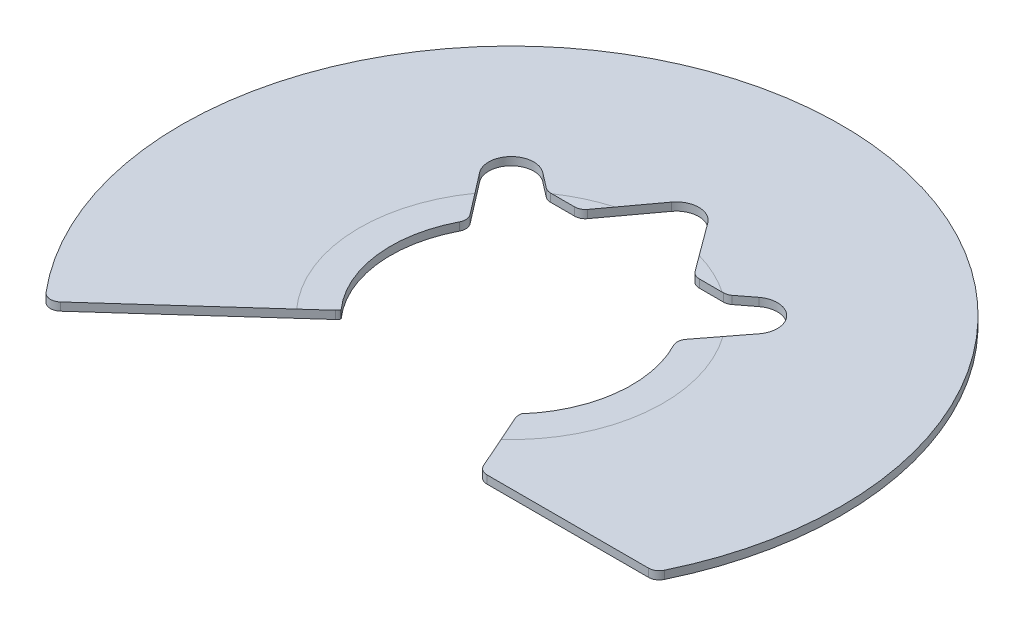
ISO-10303-21;
HEADER;
FILE_DESCRIPTION(('STEP AP214'),'2;1');
FILE_NAME('part.step','',(''),(''),'','','');
FILE_SCHEMA(('AUTOMOTIVE_DESIGN { 1 0 10303 214 1 1 1 1 }'));
ENDSEC;
DATA;
#1=APPLICATION_CONTEXT('core data for automotive mechanical design processes');
#2=APPLICATION_PROTOCOL_DEFINITION('international standard','automotive_design',2000,#1);
#3=PRODUCT_CONTEXT('',#1,'mechanical');
#4=PRODUCT('Part','Part','',(#3));
#5=PRODUCT_RELATED_PRODUCT_CATEGORY('part','',(#4));
#6=PRODUCT_DEFINITION_FORMATION('','',#4);
#7=PRODUCT_DEFINITION_CONTEXT('part definition',#1,'design');
#8=PRODUCT_DEFINITION('design','',#6,#7);
#9=PRODUCT_DEFINITION_SHAPE('','',#8);
#10=(LENGTH_UNIT() NAMED_UNIT(*) SI_UNIT(.MILLI.,.METRE.));
#11=(NAMED_UNIT(*) PLANE_ANGLE_UNIT() SI_UNIT($,.RADIAN.));
#12=(NAMED_UNIT(*) SI_UNIT($,.STERADIAN.) SOLID_ANGLE_UNIT());
#13=UNCERTAINTY_MEASURE_WITH_UNIT(LENGTH_MEASURE(1.E-05),#10,'distance_accuracy_value','');
#14=(GEOMETRIC_REPRESENTATION_CONTEXT(3) GLOBAL_UNCERTAINTY_ASSIGNED_CONTEXT((#13)) GLOBAL_UNIT_ASSIGNED_CONTEXT((#10,
#11,#12)) REPRESENTATION_CONTEXT('',''));
#15=CARTESIAN_POINT('',(0.,0.,0.));
#16=DIRECTION('',(0.,0.,1.));
#17=DIRECTION('',(1.,0.,0.));
#18=AXIS2_PLACEMENT_3D('',#15,#16,#17);
#19=CARTESIAN_POINT('',(0.,2.38125,-48.895));
#20=DIRECTION('',(0.,-1.,0.));
#21=DIRECTION('',(0.,0.,-1.));
#22=AXIS2_PLACEMENT_3D('',#19,#20,#21);
#23=CYLINDRICAL_SURFACE('',#22,6.6675);
#24=CARTESIAN_POINT('',(0.,0.,-48.895));
#25=DIRECTION('',(0.,-1.,0.));
#26=DIRECTION('',(0.,0.,1.));
#27=AXIS2_PLACEMENT_3D('',#24,#25,#26);
#28=CIRCLE('',#27,6.6675);
#29=CARTESIAN_POINT('',(-5.36619869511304,0.,-52.8522045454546));
#30=VERTEX_POINT('',#29);
#31=CARTESIAN_POINT('',(5.36619869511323,0.,-52.8522045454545));
#32=VERTEX_POINT('',#31);
#33=EDGE_CURVE('E276',#30,#32,#28,.T.);
#34=ORIENTED_EDGE('',*,*,#33,.T.);
#35=DIRECTION('',(0.,1.,0.));
#36=VECTOR('',#35,1.);
#37=CARTESIAN_POINT('',(5.36619869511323,0.,-52.8522045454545));
#38=LINE('',#37,#36);
#39=CARTESIAN_POINT('',(5.36619869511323,2.38125,-52.8522045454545));
#40=VERTEX_POINT('',#39);
#41=EDGE_CURVE('E280',#32,#40,#38,.T.);
#42=ORIENTED_EDGE('',*,*,#41,.T.);
#43=CARTESIAN_POINT('',(0.,2.38125,-48.895));
#44=DIRECTION('',(0.,-1.,0.));
#45=DIRECTION('',(0.,0.,1.));
#46=AXIS2_PLACEMENT_3D('',#43,#44,#45);
#47=CIRCLE('',#46,6.6675);
#48=CARTESIAN_POINT('',(-5.36619869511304,2.38125,-52.8522045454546));
#49=VERTEX_POINT('',#48);
#50=EDGE_CURVE('E278',#49,#40,#47,.T.);
#51=ORIENTED_EDGE('',*,*,#50,.F.);
#52=DIRECTION('',(0.,1.,0.));
#53=VECTOR('',#52,1.);
#54=CARTESIAN_POINT('',(-5.36619869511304,0.,-52.8522045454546));
#55=LINE('',#54,#53);
#56=EDGE_CURVE('E262',#30,#49,#55,.T.);
#57=ORIENTED_EDGE('',*,*,#56,.F.);
#58=EDGE_LOOP('',(#34,#42,#51,#57));
#59=FACE_BOUND('',#58,.T.);
#60=ADVANCED_FACE('F41',(#59),#23,.F.);
#61=CARTESIAN_POINT('',(0.,2.38125,-48.895));
#62=DIRECTION('',(0.,1.,0.));
#63=DIRECTION('',(0.,0.,1.));
#64=AXIS2_PLACEMENT_3D('',#61,#62,#63);
#65=PLANE('',#64);
#66=DIRECTION('',(1.,0.,0.));
#67=VECTOR('',#66,1.);
#68=CARTESIAN_POINT('',(6.66750000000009,2.38125,-37.2649155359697));
#69=LINE('',#68,#67);
#70=CARTESIAN_POINT('',(25.2185464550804,2.38125,-37.2649155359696));
#71=VERTEX_POINT('',#70);
#72=CARTESIAN_POINT('',(25.5922327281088,2.38125,-37.2649155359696));
#73=VERTEX_POINT('',#72);
#74=EDGE_CURVE('E587',#71,#73,#69,.T.);
#75=ORIENTED_EDGE('',*,*,#74,.T.);
#76=CARTESIAN_POINT('',(25.5922327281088,2.38125,-40.4399155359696));
#77=DIRECTION('',(0.,1.,0.));
#78=DIRECTION('',(0.,0.,1.));
#79=AXIS2_PLACEMENT_3D('',#76,#77,#78);
#80=CIRCLE('',#79,3.175);
#81=CARTESIAN_POINT('',(27.5250502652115,2.38125,-37.9210186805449));
#82=VERTEX_POINT('',#81);
#83=EDGE_CURVE('E474',#73,#82,#80,.T.);
#84=ORIENTED_EDGE('',*,*,#83,.T.);
#85=DIRECTION('',(0.793353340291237,0.,-0.608761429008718));
#86=VECTOR('',#85,1.);
#87=CARTESIAN_POINT('',(32.026509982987,2.38125,-41.3751102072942));
#88=LINE('',#87,#86);
#89=CARTESIAN_POINT('',(32.026509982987,2.38125,-41.3751102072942));
#90=VERTEX_POINT('',#89);
#91=EDGE_CURVE('E591',#82,#90,#88,.T.);
#92=ORIENTED_EDGE('',*,*,#91,.T.);
#93=CARTESIAN_POINT('',(36.0854268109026,2.38125,-36.0854268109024));
#94=DIRECTION('',(0.,-1.,0.));
#95=DIRECTION('',(0.,0.,1.));
#96=AXIS2_PLACEMENT_3D('',#93,#94,#95);
#97=CIRCLE('',#96,6.6675);
#98=CARTESIAN_POINT('',(41.3751102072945,2.38125,-32.0265099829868));
#99=VERTEX_POINT('',#98);
#100=EDGE_CURVE('E594',#90,#99,#97,.T.);
#101=ORIENTED_EDGE('',*,*,#100,.T.);
#102=DIRECTION('',(-0.608761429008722,0.,0.793353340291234));
#103=VECTOR('',#102,1.);
#104=CARTESIAN_POINT('',(26.7895186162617,2.38125,-13.0181969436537));
#105=LINE('',#104,#103);
#106=CARTESIAN_POINT('',(36.7368381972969,2.38125,-25.9817962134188));
#107=VERTEX_POINT('',#106);
#108=EDGE_CURVE('E598',#99,#107,#105,.T.);
#109=ORIENTED_EDGE('',*,*,#108,.T.);
#110=CARTESIAN_POINT('',(0.,2.38125,0.));
#111=DIRECTION('',(0.,1.,0.));
#112=DIRECTION('',(0.,0.,1.));
#113=AXIS2_PLACEMENT_3D('',#110,#111,#112);
#114=CIRCLE('',#113,44.9961);
#115=CARTESIAN_POINT('',(30.2689906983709,2.38125,33.2932007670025));
#116=VERTEX_POINT('',#115);
#117=EDGE_CURVE('E361',#107,#116,#114,.F.);
#118=ORIENTED_EDGE('',*,*,#117,.T.);
#119=DIRECTION('',(0.404737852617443,0.,0.914432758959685));
#120=VECTOR('',#119,1.);
#121=CARTESIAN_POINT('',(35.2071109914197,2.38125,44.45));
#122=LINE('',#121,#120);
#123=CARTESIAN_POINT('',(34.3705953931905,2.38125,42.5600426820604));
#124=VERTEX_POINT('',#123);
#125=EDGE_CURVE('E606',#116,#124,#122,.T.);
#126=ORIENTED_EDGE('',*,*,#125,.T.);
#127=CARTESIAN_POINT('',(37.2739194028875,2.38125,41.275));
#128=DIRECTION('',(0.,1.,0.));
#129=DIRECTION('',(0.,0.,1.));
#130=AXIS2_PLACEMENT_3D('',#127,#128,#129);
#131=CIRCLE('',#130,3.175);
#132=CARTESIAN_POINT('',(37.2739194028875,2.38125,44.45));
#133=VERTEX_POINT('',#132);
#134=EDGE_CURVE('E465',#124,#133,#131,.T.);
#135=ORIENTED_EDGE('',*,*,#134,.T.);
#136=DIRECTION('',(1.,0.,0.));
#137=VECTOR('',#136,1.);
#138=CARTESIAN_POINT('',(35.2071109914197,2.38125,44.45));
#139=LINE('',#138,#137);
#140=CARTESIAN_POINT('',(85.1373748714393,2.38125,44.45));
#141=VERTEX_POINT('',#140);
#142=EDGE_CURVE('E533',#133,#141,#139,.T.);
#143=ORIENTED_EDGE('',*,*,#142,.T.);
#144=CARTESIAN_POINT('',(85.1373748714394,2.38125,41.275));
#145=DIRECTION('',(0.,1.,0.));
#146=DIRECTION('',(0.,0.,1.));
#147=AXIS2_PLACEMENT_3D('',#144,#145,#146);
#148=CIRCLE('',#147,3.175);
#149=CARTESIAN_POINT('',(87.9943337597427,2.38125,42.660067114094));
#150=VERTEX_POINT('',#149);
#151=EDGE_CURVE('E468',#141,#150,#148,.T.);
#152=ORIENTED_EDGE('',*,*,#151,.T.);
#153=CARTESIAN_POINT('',(0.,2.38125,0.));
#154=DIRECTION('',(0.,1.,0.));
#155=DIRECTION('',(0.,0.,1.));
#156=AXIS2_PLACEMENT_3D('',#153,#154,#155);
#157=CIRCLE('',#156,97.79);
#158=CARTESIAN_POINT('',(-74.8269850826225,2.38125,62.958767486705));
#159=VERTEX_POINT('',#158);
#160=EDGE_CURVE('E528',#150,#159,#157,.T.);
#161=ORIENTED_EDGE('',*,*,#160,.T.);
#162=CARTESIAN_POINT('',(-72.3975375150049,2.38125,60.9146516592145));
#163=DIRECTION('',(0.,1.,0.));
#164=DIRECTION('',(0.,0.,1.));
#165=AXIS2_PLACEMENT_3D('',#162,#163,#164);
#166=CIRCLE('',#165,3.175);
#167=CARTESIAN_POINT('',(-70.2730478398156,2.38125,63.2741364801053));
#168=VERTEX_POINT('',#167);
#169=EDGE_CURVE('E65',#159,#168,#166,.T.);
#170=ORIENTED_EDGE('',*,*,#169,.T.);
#171=DIRECTION('',(0.743144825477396,0.,-0.669130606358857));
#172=VECTOR('',#171,1.);
#173=CARTESIAN_POINT('',(-72.6721324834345,2.38125,65.4342819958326));
#174=LINE('',#173,#172);
#175=CARTESIAN_POINT('',(-33.4386188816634,2.38125,30.1082676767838));
#176=VERTEX_POINT('',#175);
#177=EDGE_CURVE('E510',#168,#176,#174,.T.);
#178=ORIENTED_EDGE('',*,*,#177,.T.);
#179=CARTESIAN_POINT('',(-36.7368381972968,2.38125,-25.981796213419));
#180=VERTEX_POINT('',#179);
#181=EDGE_CURVE('E366',#176,#180,#114,.F.);
#182=ORIENTED_EDGE('',*,*,#181,.T.);
#183=DIRECTION('',(-0.608761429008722,0.,-0.793353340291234));
#184=VECTOR('',#183,1.);
#185=CARTESIAN_POINT('',(-41.3751102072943,2.38125,-32.0265099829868));
#186=LINE('',#185,#184);
#187=CARTESIAN_POINT('',(-41.3751102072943,2.38125,-32.0265099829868));
#188=VERTEX_POINT('',#187);
#189=EDGE_CURVE('E532',#180,#188,#186,.T.);
#190=ORIENTED_EDGE('',*,*,#189,.T.);
#191=CARTESIAN_POINT('',(-36.0854268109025,2.38125,-36.0854268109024));
#192=DIRECTION('',(0.,-1.,0.));
#193=DIRECTION('',(0.,0.,1.));
#194=AXIS2_PLACEMENT_3D('',#191,#192,#193);
#195=CIRCLE('',#194,6.6675);
#196=CARTESIAN_POINT('',(-32.0265099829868,2.38125,-41.3751102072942));
#197=VERTEX_POINT('',#196);
#198=EDGE_CURVE('E540',#188,#197,#195,.T.);
#199=ORIENTED_EDGE('',*,*,#198,.T.);
#200=DIRECTION('',(0.793353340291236,0.,0.608761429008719));
#201=VECTOR('',#200,1.);
#202=CARTESIAN_POINT('',(-26.67,2.38125,-37.2649155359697));
#203=LINE('',#202,#201);
#204=CARTESIAN_POINT('',(-27.5250502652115,2.38125,-37.9210186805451));
#205=VERTEX_POINT('',#204);
#206=EDGE_CURVE('E542',#197,#205,#203,.T.);
#207=ORIENTED_EDGE('',*,*,#206,.T.);
#208=CARTESIAN_POINT('',(-25.5922327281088,2.38125,-40.4399155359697));
#209=DIRECTION('',(0.,1.,0.));
#210=DIRECTION('',(0.,0.,1.));
#211=AXIS2_PLACEMENT_3D('',#208,#209,#210);
#212=CIRCLE('',#211,3.175);
#213=CARTESIAN_POINT('',(-25.5922327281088,2.38125,-37.2649155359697));
#214=VERTEX_POINT('',#213);
#215=EDGE_CURVE('E471',#205,#214,#212,.T.);
#216=ORIENTED_EDGE('',*,*,#215,.T.);
#217=DIRECTION('',(1.,0.,0.));
#218=VECTOR('',#217,1.);
#219=CARTESIAN_POINT('',(-26.67,2.38125,-37.2649155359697));
#220=LINE('',#219,#218);
#221=CARTESIAN_POINT('',(-25.2185464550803,2.38125,-37.2649155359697));
#222=VERTEX_POINT('',#221);
#223=EDGE_CURVE('E300',#214,#222,#220,.T.);
#224=ORIENTED_EDGE('',*,*,#223,.T.);
#225=CARTESIAN_POINT('',(-12.4563201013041,2.38125,-43.2375890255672));
#226=VERTEX_POINT('',#225);
#227=EDGE_CURVE('E556',#222,#226,#114,.F.);
#228=ORIENTED_EDGE('',*,*,#227,.T.);
#229=DIRECTION('',(-0.593506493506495,0.,0.804829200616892));
#230=VECTOR('',#229,1.);
#231=CARTESIAN_POINT('',(-5.36619869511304,2.38125,-52.8522045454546));
#232=LINE('',#231,#230);
#233=EDGE_CURVE('E568',#49,#226,#232,.T.);
#234=ORIENTED_EDGE('',*,*,#233,.F.);
#235=ORIENTED_EDGE('',*,*,#50,.T.);
#236=DIRECTION('',(-0.593506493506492,0.,-0.804829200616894));
#237=VECTOR('',#236,1.);
#238=CARTESIAN_POINT('',(5.36619869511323,2.38125,-52.8522045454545));
#239=LINE('',#238,#237);
#240=CARTESIAN_POINT('',(12.4563201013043,2.38125,-43.2375890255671));
#241=VERTEX_POINT('',#240);
#242=EDGE_CURVE('E578',#241,#40,#239,.T.);
#243=ORIENTED_EDGE('',*,*,#242,.F.);
#244=EDGE_CURVE('E365',#241,#71,#114,.F.);
#245=ORIENTED_EDGE('',*,*,#244,.T.);
#246=EDGE_LOOP('',(#75,#84,#92,#101,#109,#118,#126,#135,#143,#152,#161,#170,#178,#182,#190,#199,
#207,#216,#224,#228,#234,#235,#243,#245));
#247=FACE_BOUND('',#246,.T.);
#248=ADVANCED_FACE('F555',(#247),#65,.T.);
#249=CARTESIAN_POINT('',(0.,2.38125,0.));
#250=DIRECTION('',(0.,1.,0.));
#251=DIRECTION('',(0.,0.,1.));
#252=AXIS2_PLACEMENT_3D('',#249,#250,#251);
#253=CIRCLE('',#252,35.687);
#254=CARTESIAN_POINT('',(-31.69202308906,2.38125,-16.4066340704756));
#255=VERTEX_POINT('',#254);
#256=CARTESIAN_POINT('',(-26.67,2.38125,23.7122978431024));
#257=VERTEX_POINT('',#256);
#258=EDGE_CURVE('E577',#255,#257,#253,.T.);
#259=ORIENTED_EDGE('',*,*,#258,.F.);
#260=CARTESIAN_POINT('',(-34.5115980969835,2.38125,-17.8662990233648));
#261=DIRECTION('',(0.,1.,0.));
#262=DIRECTION('',(0.,0.,1.));
#263=AXIS2_PLACEMENT_3D('',#260,#261,#262);
#264=CIRCLE('',#263,3.175);
#265=CARTESIAN_POINT('',(-31.9927012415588,2.38125,-19.7991165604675));
#266=VERTEX_POINT('',#265);
#267=EDGE_CURVE('E456',#255,#266,#264,.T.);
#268=ORIENTED_EDGE('',*,*,#267,.T.);
#269=EDGE_CURVE('E537',#266,#180,#186,.T.);
#270=ORIENTED_EDGE('',*,*,#269,.T.);
#271=ORIENTED_EDGE('',*,*,#181,.F.);
#272=CARTESIAN_POINT('',(-27.3906995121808,2.38125,24.6626966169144));
#273=VERTEX_POINT('',#272);
#274=EDGE_CURVE('E520',#176,#273,#174,.T.);
#275=ORIENTED_EDGE('',*,*,#274,.T.);
#276=CARTESIAN_POINT('',(-29.5151891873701,2.38125,22.3032117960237));
#277=DIRECTION('',(0.,1.,0.));
#278=DIRECTION('',(0.,0.,1.));
#279=AXIS2_PLACEMENT_3D('',#276,#277,#278);
#280=CIRCLE('',#279,3.175);
#281=EDGE_CURVE('E453',#273,#257,#280,.T.);
#282=ORIENTED_EDGE('',*,*,#281,.T.);
#283=EDGE_LOOP('',(#259,#268,#270,#271,#275,#282));
#284=FACE_BOUND('',#283,.T.);
#285=ADVANCED_FACE('F524',(#284),#65,.T.);
#286=CARTESIAN_POINT('',(-18.4643493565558,2.38125,-37.2649155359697));
#287=VERTEX_POINT('',#286);
#288=EDGE_CURVE('E544',#222,#287,#220,.T.);
#289=ORIENTED_EDGE('',*,*,#288,.T.);
#290=CARTESIAN_POINT('',(-18.4643493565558,2.38125,-40.4399155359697));
#291=DIRECTION('',(0.,1.,0.));
#292=DIRECTION('',(0.,0.,1.));
#293=AXIS2_PLACEMENT_3D('',#290,#291,#292);
#294=CIRCLE('',#293,3.175);
#295=CARTESIAN_POINT('',(-15.9090166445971,2.38125,-38.5555324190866));
#296=VERTEX_POINT('',#295);
#297=EDGE_CURVE('E441',#287,#296,#294,.T.);
#298=ORIENTED_EDGE('',*,*,#297,.T.);
#299=EDGE_CURVE('E561',#226,#296,#232,.T.);
#300=ORIENTED_EDGE('',*,*,#299,.F.);
#301=ORIENTED_EDGE('',*,*,#227,.F.);
#302=EDGE_LOOP('',(#289,#298,#300,#301));
#303=FACE_BOUND('',#302,.T.);
#304=ADVANCED_FACE('F560',(#303),#65,.T.);
#305=CARTESIAN_POINT('',(15.9090166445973,2.38125,-38.5555324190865));
#306=VERTEX_POINT('',#305);
#307=EDGE_CURVE('E270',#306,#241,#239,.T.);
#308=ORIENTED_EDGE('',*,*,#307,.F.);
#309=CARTESIAN_POINT('',(18.4643493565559,2.38125,-40.4399155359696));
#310=DIRECTION('',(0.,1.,0.));
#311=DIRECTION('',(0.,0.,1.));
#312=AXIS2_PLACEMENT_3D('',#309,#310,#311);
#313=CIRCLE('',#312,3.175);
#314=CARTESIAN_POINT('',(18.4643493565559,2.38125,-37.2649155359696));
#315=VERTEX_POINT('',#314);
#316=EDGE_CURVE('E417',#306,#315,#313,.T.);
#317=ORIENTED_EDGE('',*,*,#316,.T.);
#318=EDGE_CURVE('E588',#315,#71,#69,.T.);
#319=ORIENTED_EDGE('',*,*,#318,.T.);
#320=ORIENTED_EDGE('',*,*,#244,.F.);
#321=EDGE_LOOP('',(#308,#317,#319,#320));
#322=FACE_BOUND('',#321,.T.);
#323=ADVANCED_FACE('F847',(#322),#65,.T.);
#324=CARTESIAN_POINT('',(6.66750000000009,2.38125,-37.2649155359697));
#325=DIRECTION('',(0.,0.,-1.));
#326=DIRECTION('',(-1.,0.,0.));
#327=AXIS2_PLACEMENT_3D('',#324,#325,#326);
#328=PLANE('',#327);
#329=ORIENTED_EDGE('',*,*,#318,.F.);
#330=DIRECTION('',(0.,-1.,0.));
#331=VECTOR('',#330,1.);
#332=CARTESIAN_POINT('',(18.4643493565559,2.38125,-37.2649155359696));
#333=LINE('',#332,#331);
#334=CARTESIAN_POINT('',(18.4643493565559,0.,-37.2649155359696));
#335=VERTEX_POINT('',#334);
#336=EDGE_CURVE('E377',#315,#335,#333,.T.);
#337=ORIENTED_EDGE('',*,*,#336,.T.);
#338=DIRECTION('',(1.,0.,0.));
#339=VECTOR('',#338,1.);
#340=CARTESIAN_POINT('',(6.66750000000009,0.,-37.2649155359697));
#341=LINE('',#340,#339);
#342=CARTESIAN_POINT('',(25.5922327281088,0.,-37.2649155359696));
#343=VERTEX_POINT('',#342);
#344=EDGE_CURVE('E288',#335,#343,#341,.T.);
#345=ORIENTED_EDGE('',*,*,#344,.T.);
#346=DIRECTION('',(0.,-1.,0.));
#347=VECTOR('',#346,1.);
#348=CARTESIAN_POINT('',(25.5922327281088,2.38125,-37.2649155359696));
#349=LINE('',#348,#347);
#350=EDGE_CURVE('E374',#343,#73,#349,.F.);
#351=ORIENTED_EDGE('',*,*,#350,.T.);
#352=ORIENTED_EDGE('',*,*,#74,.F.);
#353=EDGE_LOOP('',(#329,#337,#345,#351,#352));
#354=FACE_BOUND('',#353,.T.);
#355=ADVANCED_FACE('F688',(#354),#328,.F.);
#356=CARTESIAN_POINT('',(32.026509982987,2.38125,-41.3751102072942));
#357=DIRECTION('',(-0.608761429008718,0.,-0.793353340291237));
#358=DIRECTION('',(-0.793353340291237,0.,0.608761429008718));
#359=AXIS2_PLACEMENT_3D('',#356,#357,#358);
#360=PLANE('',#359);
#361=ORIENTED_EDGE('',*,*,#91,.F.);
#362=DIRECTION('',(0.,-1.,0.));
#363=VECTOR('',#362,1.);
#364=CARTESIAN_POINT('',(27.5250502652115,2.38125,-37.9210186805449));
#365=LINE('',#364,#363);
#366=CARTESIAN_POINT('',(27.5250502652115,0.,-37.9210186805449));
#367=VERTEX_POINT('',#366);
#368=EDGE_CURVE('E459',#82,#367,#365,.T.);
#369=ORIENTED_EDGE('',*,*,#368,.T.);
#370=DIRECTION('',(0.793353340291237,0.,-0.608761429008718));
#371=VECTOR('',#370,1.);
#372=CARTESIAN_POINT('',(32.026509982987,0.,-41.3751102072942));
#373=LINE('',#372,#371);
#374=CARTESIAN_POINT('',(32.026509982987,0.,-41.3751102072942));
#375=VERTEX_POINT('',#374);
#376=EDGE_CURVE('E294',#367,#375,#373,.T.);
#377=ORIENTED_EDGE('',*,*,#376,.T.);
#378=DIRECTION('',(0.,-1.,0.));
#379=VECTOR('',#378,1.);
#380=CARTESIAN_POINT('',(32.026509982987,2.38125,-41.3751102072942));
#381=LINE('',#380,#379);
#382=EDGE_CURVE('E357',#90,#375,#381,.T.);
#383=ORIENTED_EDGE('',*,*,#382,.F.);
#384=EDGE_LOOP('',(#361,#369,#377,#383));
#385=FACE_BOUND('',#384,.T.);
#386=ADVANCED_FACE('F700',(#385),#360,.F.);
#387=CARTESIAN_POINT('',(36.0854268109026,2.38125,-36.0854268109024));
#388=DIRECTION('',(0.,-1.,0.));
#389=DIRECTION('',(0.,0.,-1.));
#390=AXIS2_PLACEMENT_3D('',#387,#388,#389);
#391=CYLINDRICAL_SURFACE('',#390,6.6675);
#392=CARTESIAN_POINT('',(36.0854268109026,0.,-36.0854268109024));
#393=DIRECTION('',(0.,-1.,0.));
#394=DIRECTION('',(0.,0.,1.));
#395=AXIS2_PLACEMENT_3D('',#392,#393,#394);
#396=CIRCLE('',#395,6.6675);
#397=CARTESIAN_POINT('',(41.3751102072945,0.,-32.0265099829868));
#398=VERTEX_POINT('',#397);
#399=EDGE_CURVE('E305',#375,#398,#396,.T.);
#400=ORIENTED_EDGE('',*,*,#399,.T.);
#401=DIRECTION('',(0.,-1.,0.));
#402=VECTOR('',#401,1.);
#403=CARTESIAN_POINT('',(41.3751102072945,2.38125,-32.0265099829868));
#404=LINE('',#403,#402);
#405=EDGE_CURVE('E353',#99,#398,#404,.T.);
#406=ORIENTED_EDGE('',*,*,#405,.F.);
#407=ORIENTED_EDGE('',*,*,#100,.F.);
#408=ORIENTED_EDGE('',*,*,#382,.T.);
#409=EDGE_LOOP('',(#400,#406,#407,#408));
#410=FACE_BOUND('',#409,.T.);
#411=ADVANCED_FACE('F698',(#410),#391,.F.);
#412=CARTESIAN_POINT('',(26.7895186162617,2.38125,-13.0181969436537));
#413=DIRECTION('',(0.793353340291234,0.,0.608761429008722));
#414=DIRECTION('',(0.608761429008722,0.,-0.793353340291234));
#415=AXIS2_PLACEMENT_3D('',#412,#413,#414);
#416=PLANE('',#415);
#417=DIRECTION('',(-0.608761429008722,0.,0.793353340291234));
#418=VECTOR('',#417,1.);
#419=CARTESIAN_POINT('',(26.7895186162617,0.,-13.0181969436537));
#420=LINE('',#419,#418);
#421=CARTESIAN_POINT('',(31.9927012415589,0.,-19.7991165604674));
#422=VERTEX_POINT('',#421);
#423=EDGE_CURVE('E308',#398,#422,#420,.T.);
#424=ORIENTED_EDGE('',*,*,#423,.T.);
#425=DIRECTION('',(0.,1.,0.));
#426=VECTOR('',#425,1.);
#427=CARTESIAN_POINT('',(31.9927012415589,2.38125,-19.7991165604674));
#428=LINE('',#427,#426);
#429=CARTESIAN_POINT('',(31.9927012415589,2.38125,-19.7991165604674));
#430=VERTEX_POINT('',#429);
#431=EDGE_CURVE('E420',#422,#430,#428,.T.);
#432=ORIENTED_EDGE('',*,*,#431,.T.);
#433=EDGE_CURVE('E597',#107,#430,#105,.T.);
#434=ORIENTED_EDGE('',*,*,#433,.F.);
#435=ORIENTED_EDGE('',*,*,#108,.F.);
#436=ORIENTED_EDGE('',*,*,#405,.T.);
#437=EDGE_LOOP('',(#424,#432,#434,#435,#436));
#438=FACE_BOUND('',#437,.T.);
#439=ADVANCED_FACE('F658',(#438),#416,.F.);
#440=CARTESIAN_POINT('',(26.67,2.38125,25.1619252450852));
#441=DIRECTION('',(1.,0.,0.));
#442=DIRECTION('',(0.,0.,-1.));
#443=AXIS2_PLACEMENT_3D('',#440,#441,#442);
#444=PLANE('',#443);
#445=DIRECTION('',(0.,0.,1.));
#446=VECTOR('',#445,1.);
#447=CARTESIAN_POINT('',(26.67,0.,25.1619252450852));
#448=LINE('',#447,#446);
#449=CARTESIAN_POINT('',(26.67,0.,23.7122978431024));
#450=VERTEX_POINT('',#449);
#451=CARTESIAN_POINT('',(26.67,0.,24.4906858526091));
#452=VERTEX_POINT('',#451);
#453=EDGE_CURVE('E312',#450,#452,#448,.T.);
#454=ORIENTED_EDGE('',*,*,#453,.T.);
#455=DIRECTION('',(0.,-1.,0.));
#456=VECTOR('',#455,1.);
#457=CARTESIAN_POINT('',(26.67,2.38125,24.4906858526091));
#458=LINE('',#457,#456);
#459=CARTESIAN_POINT('',(26.67,2.38125,24.4906858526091));
#460=VERTEX_POINT('',#459);
#461=EDGE_CURVE('E500',#452,#460,#458,.F.);
#462=ORIENTED_EDGE('',*,*,#461,.T.);
#463=DIRECTION('',(0.,0.,1.));
#464=VECTOR('',#463,1.);
#465=CARTESIAN_POINT('',(26.67,2.38125,25.1619252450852));
#466=LINE('',#465,#464);
#467=CARTESIAN_POINT('',(26.67,2.38125,23.7122978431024));
#468=VERTEX_POINT('',#467);
#469=EDGE_CURVE('E602',#468,#460,#466,.T.);
#470=ORIENTED_EDGE('',*,*,#469,.F.);
#471=DIRECTION('',(0.,1.,0.));
#472=VECTOR('',#471,1.);
#473=CARTESIAN_POINT('',(26.67,0.,23.7122978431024));
#474=LINE('',#473,#472);
#475=EDGE_CURVE('E289',#468,#450,#474,.F.);
#476=ORIENTED_EDGE('',*,*,#475,.T.);
#477=EDGE_LOOP('',(#454,#462,#470,#476));
#478=FACE_BOUND('',#477,.T.);
#479=ADVANCED_FACE('F643',(#478),#444,.F.);
#480=CARTESIAN_POINT('',(35.2071109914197,2.38125,44.45));
#481=DIRECTION('',(0.914432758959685,0.,-0.404737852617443));
#482=DIRECTION('',(-0.404737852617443,0.,-0.914432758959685));
#483=AXIS2_PLACEMENT_3D('',#480,#481,#482);
#484=PLANE('',#483);
#485=DIRECTION('',(0.404737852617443,0.,0.914432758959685));
#486=VECTOR('',#485,1.);
#487=CARTESIAN_POINT('',(35.2071109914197,0.,44.45));
#488=LINE('',#487,#486);
#489=CARTESIAN_POINT('',(26.941675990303,0.,25.7757285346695));
#490=VERTEX_POINT('',#489);
#491=CARTESIAN_POINT('',(34.3705953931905,0.,42.5600426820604));
#492=VERTEX_POINT('',#491);
#493=EDGE_CURVE('E316',#490,#492,#488,.T.);
#494=ORIENTED_EDGE('',*,*,#493,.T.);
#495=DIRECTION('',(0.,-1.,0.));
#496=VECTOR('',#495,1.);
#497=CARTESIAN_POINT('',(34.3705953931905,2.38125,42.5600426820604));
#498=LINE('',#497,#496);
#499=EDGE_CURVE('E497',#492,#124,#498,.F.);
#500=ORIENTED_EDGE('',*,*,#499,.T.);
#501=ORIENTED_EDGE('',*,*,#125,.F.);
#502=CARTESIAN_POINT('',(26.941675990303,2.38125,25.7757285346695));
#503=VERTEX_POINT('',#502);
#504=EDGE_CURVE('E607',#503,#116,#122,.T.);
#505=ORIENTED_EDGE('',*,*,#504,.F.);
#506=DIRECTION('',(0.,-1.,0.));
#507=VECTOR('',#506,1.);
#508=CARTESIAN_POINT('',(26.941675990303,2.38125,25.7757285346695));
#509=LINE('',#508,#507);
#510=EDGE_CURVE('E493',#503,#490,#509,.T.);
#511=ORIENTED_EDGE('',*,*,#510,.T.);
#512=EDGE_LOOP('',(#494,#500,#501,#505,#511));
#513=FACE_BOUND('',#512,.T.);
#514=ADVANCED_FACE('F632',(#513),#484,.F.);
#515=CARTESIAN_POINT('',(35.2071109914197,2.38125,44.45));
#516=DIRECTION('',(0.,0.,-1.));
#517=DIRECTION('',(-1.,0.,0.));
#518=AXIS2_PLACEMENT_3D('',#515,#516,#517);
#519=PLANE('',#518);
#520=DIRECTION('',(1.,0.,0.));
#521=VECTOR('',#520,1.);
#522=CARTESIAN_POINT('',(35.2071109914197,0.,44.45));
#523=LINE('',#522,#521);
#524=CARTESIAN_POINT('',(37.2739194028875,0.,44.45));
#525=VERTEX_POINT('',#524);
#526=CARTESIAN_POINT('',(85.1373748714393,0.,44.45));
#527=VERTEX_POINT('',#526);
#528=EDGE_CURVE('E320',#525,#527,#523,.T.);
#529=ORIENTED_EDGE('',*,*,#528,.T.);
#530=DIRECTION('',(0.,-1.,0.));
#531=VECTOR('',#530,1.);
#532=CARTESIAN_POINT('',(85.1373748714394,2.38125,44.45));
#533=LINE('',#532,#531);
#534=EDGE_CURVE('E490',#527,#141,#533,.F.);
#535=ORIENTED_EDGE('',*,*,#534,.T.);
#536=ORIENTED_EDGE('',*,*,#142,.F.);
#537=DIRECTION('',(0.,-1.,0.));
#538=VECTOR('',#537,1.);
#539=CARTESIAN_POINT('',(37.2739194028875,2.38125,44.45));
#540=LINE('',#539,#538);
#541=EDGE_CURVE('E486',#133,#525,#540,.T.);
#542=ORIENTED_EDGE('',*,*,#541,.T.);
#543=EDGE_LOOP('',(#529,#535,#536,#542));
#544=FACE_BOUND('',#543,.T.);
#545=ADVANCED_FACE('F626',(#544),#519,.F.);
#546=CARTESIAN_POINT('',(0.,2.38125,0.));
#547=DIRECTION('',(0.,-1.,0.));
#548=DIRECTION('',(0.,0.,-1.));
#549=AXIS2_PLACEMENT_3D('',#546,#547,#548);
#550=CYLINDRICAL_SURFACE('',#549,97.79);
#551=ORIENTED_EDGE('',*,*,#160,.F.);
#552=DIRECTION('',(0.,-1.,0.));
#553=VECTOR('',#552,1.);
#554=CARTESIAN_POINT('',(87.9943337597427,2.38125,42.660067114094));
#555=LINE('',#554,#553);
#556=CARTESIAN_POINT('',(87.9943337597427,0.,42.660067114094));
#557=VERTEX_POINT('',#556);
#558=EDGE_CURVE('E482',#150,#557,#555,.T.);
#559=ORIENTED_EDGE('',*,*,#558,.T.);
#560=CARTESIAN_POINT('',(0.,0.,0.));
#561=DIRECTION('',(0.,1.,0.));
#562=DIRECTION('',(0.,0.,1.));
#563=AXIS2_PLACEMENT_3D('',#560,#561,#562);
#564=CIRCLE('',#563,97.79);
#565=CARTESIAN_POINT('',(-74.8269850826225,0.,62.958767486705));
#566=VERTEX_POINT('',#565);
#567=EDGE_CURVE('E324',#557,#566,#564,.T.);
#568=ORIENTED_EDGE('',*,*,#567,.T.);
#569=DIRECTION('',(0.,-1.,0.));
#570=VECTOR('',#569,1.);
#571=CARTESIAN_POINT('',(-74.8269850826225,2.38125,62.958767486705));
#572=LINE('',#571,#570);
#573=EDGE_CURVE('E479',#566,#159,#572,.F.);
#574=ORIENTED_EDGE('',*,*,#573,.T.);
#575=EDGE_LOOP('',(#551,#559,#568,#574));
#576=FACE_BOUND('',#575,.T.);
#577=ADVANCED_FACE('F623',(#576),#550,.T.);
#578=CARTESIAN_POINT('',(-72.6721324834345,2.38125,65.4342819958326));
#579=DIRECTION('',(-0.669130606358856,0.,-0.743144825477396));
#580=DIRECTION('',(-0.743144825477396,0.,0.669130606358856));
#581=AXIS2_PLACEMENT_3D('',#578,#579,#580);
#582=PLANE('',#581);
#583=DIRECTION('',(0.743144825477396,0.,-0.669130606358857));
#584=VECTOR('',#583,1.);
#585=CARTESIAN_POINT('',(-72.6721324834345,0.,65.4342819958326));
#586=LINE('',#585,#584);
#587=CARTESIAN_POINT('',(-70.2730478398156,0.,63.2741364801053));
#588=VERTEX_POINT('',#587);
#589=CARTESIAN_POINT('',(-27.3906995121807,0.,24.6626966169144));
#590=VERTEX_POINT('',#589);
#591=EDGE_CURVE('E328',#588,#590,#586,.T.);
#592=ORIENTED_EDGE('',*,*,#591,.T.);
#593=DIRECTION('',(0.,1.,0.));
#594=VECTOR('',#593,1.);
#595=CARTESIAN_POINT('',(-27.3906995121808,2.38125,24.6626966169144));
#596=LINE('',#595,#594);
#597=EDGE_CURVE('E11',#590,#273,#596,.T.);
#598=ORIENTED_EDGE('',*,*,#597,.T.);
#599=ORIENTED_EDGE('',*,*,#274,.F.);
#600=ORIENTED_EDGE('',*,*,#177,.F.);
#601=DIRECTION('',(0.,-1.,0.));
#602=VECTOR('',#601,1.);
#603=CARTESIAN_POINT('',(-70.2730478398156,2.38125,63.2741364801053));
#604=LINE('',#603,#602);
#605=EDGE_CURVE('E50',#168,#588,#604,.T.);
#606=ORIENTED_EDGE('',*,*,#605,.T.);
#607=EDGE_LOOP('',(#592,#598,#599,#600,#606));
#608=FACE_BOUND('',#607,.T.);
#609=ADVANCED_FACE('F507',(#608),#582,.F.);
#610=CARTESIAN_POINT('',(-41.3751102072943,2.38125,-32.0265099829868));
#611=DIRECTION('',(-0.793353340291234,0.,0.608761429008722));
#612=DIRECTION('',(0.608761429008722,0.,0.793353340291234));
#613=AXIS2_PLACEMENT_3D('',#610,#611,#612);
#614=PLANE('',#613);
#615=ORIENTED_EDGE('',*,*,#269,.F.);
#616=DIRECTION('',(0.,1.,0.));
#617=VECTOR('',#616,1.);
#618=CARTESIAN_POINT('',(-31.9927012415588,2.38125,-19.7991165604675));
#619=LINE('',#618,#617);
#620=CARTESIAN_POINT('',(-31.9927012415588,0.,-19.7991165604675));
#621=VERTEX_POINT('',#620);
#622=EDGE_CURVE('E446',#266,#621,#619,.F.);
#623=ORIENTED_EDGE('',*,*,#622,.T.);
#624=DIRECTION('',(-0.608761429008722,0.,-0.793353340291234));
#625=VECTOR('',#624,1.);
#626=CARTESIAN_POINT('',(-41.3751102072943,0.,-32.0265099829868));
#627=LINE('',#626,#625);
#628=CARTESIAN_POINT('',(-41.3751102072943,0.,-32.0265099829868));
#629=VERTEX_POINT('',#628);
#630=EDGE_CURVE('E332',#621,#629,#627,.T.);
#631=ORIENTED_EDGE('',*,*,#630,.T.);
#632=DIRECTION('',(0.,-1.,0.));
#633=VECTOR('',#632,1.);
#634=CARTESIAN_POINT('',(-41.3751102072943,2.38125,-32.0265099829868));
#635=LINE('',#634,#633);
#636=EDGE_CURVE('E349',#188,#629,#635,.T.);
#637=ORIENTED_EDGE('',*,*,#636,.F.);
#638=ORIENTED_EDGE('',*,*,#189,.F.);
#639=EDGE_LOOP('',(#615,#623,#631,#637,#638));
#640=FACE_BOUND('',#639,.T.);
#641=ADVANCED_FACE('F929',(#640),#614,.F.);
#642=CARTESIAN_POINT('',(-36.0854268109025,2.38125,-36.0854268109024));
#643=DIRECTION('',(0.,-1.,0.));
#644=DIRECTION('',(0.,0.,-1.));
#645=AXIS2_PLACEMENT_3D('',#642,#643,#644);
#646=CYLINDRICAL_SURFACE('',#645,6.6675);
#647=CARTESIAN_POINT('',(-36.0854268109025,0.,-36.0854268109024));
#648=DIRECTION('',(0.,-1.,0.));
#649=DIRECTION('',(0.,0.,1.));
#650=AXIS2_PLACEMENT_3D('',#647,#648,#649);
#651=CIRCLE('',#650,6.6675);
#652=CARTESIAN_POINT('',(-32.0265099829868,0.,-41.3751102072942));
#653=VERTEX_POINT('',#652);
#654=EDGE_CURVE('E335',#629,#653,#651,.T.);
#655=ORIENTED_EDGE('',*,*,#654,.T.);
#656=DIRECTION('',(0.,-1.,0.));
#657=VECTOR('',#656,1.);
#658=CARTESIAN_POINT('',(-32.0265099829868,2.38125,-41.3751102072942));
#659=LINE('',#658,#657);
#660=EDGE_CURVE('E345',#197,#653,#659,.T.);
#661=ORIENTED_EDGE('',*,*,#660,.F.);
#662=ORIENTED_EDGE('',*,*,#198,.F.);
#663=ORIENTED_EDGE('',*,*,#636,.T.);
#664=EDGE_LOOP('',(#655,#661,#662,#663));
#665=FACE_BOUND('',#664,.T.);
#666=ADVANCED_FACE('F936',(#665),#646,.F.);
#667=CARTESIAN_POINT('',(-26.67,2.38125,-37.2649155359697));
#668=DIRECTION('',(0.608761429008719,0.,-0.793353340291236));
#669=DIRECTION('',(-0.793353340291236,0.,-0.608761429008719));
#670=AXIS2_PLACEMENT_3D('',#667,#668,#669);
#671=PLANE('',#670);
#672=DIRECTION('',(0.793353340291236,0.,0.608761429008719));
#673=VECTOR('',#672,1.);
#674=CARTESIAN_POINT('',(-26.67,0.,-37.2649155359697));
#675=LINE('',#674,#673);
#676=CARTESIAN_POINT('',(-27.5250502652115,0.,-37.9210186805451));
#677=VERTEX_POINT('',#676);
#678=EDGE_CURVE('E338',#653,#677,#675,.T.);
#679=ORIENTED_EDGE('',*,*,#678,.T.);
#680=DIRECTION('',(0.,-1.,0.));
#681=VECTOR('',#680,1.);
#682=CARTESIAN_POINT('',(-27.5250502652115,2.38125,-37.9210186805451));
#683=LINE('',#682,#681);
#684=EDGE_CURVE('E57',#677,#205,#683,.F.);
#685=ORIENTED_EDGE('',*,*,#684,.T.);
#686=ORIENTED_EDGE('',*,*,#206,.F.);
#687=ORIENTED_EDGE('',*,*,#660,.T.);
#688=EDGE_LOOP('',(#679,#685,#686,#687));
#689=FACE_BOUND('',#688,.T.);
#690=ADVANCED_FACE('F944',(#689),#671,.F.);
#691=CARTESIAN_POINT('',(-26.67,2.38125,-37.2649155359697));
#692=DIRECTION('',(0.,0.,-1.));
#693=DIRECTION('',(-1.,0.,0.));
#694=AXIS2_PLACEMENT_3D('',#691,#692,#693);
#695=PLANE('',#694);
#696=DIRECTION('',(1.,0.,0.));
#697=VECTOR('',#696,1.);
#698=CARTESIAN_POINT('',(-26.67,0.,-37.2649155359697));
#699=LINE('',#698,#697);
#700=CARTESIAN_POINT('',(-25.5922327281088,0.,-37.2649155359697));
#701=VERTEX_POINT('',#700);
#702=CARTESIAN_POINT('',(-18.4643493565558,0.,-37.2649155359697));
#703=VERTEX_POINT('',#702);
#704=EDGE_CURVE('E341',#701,#703,#699,.T.);
#705=ORIENTED_EDGE('',*,*,#704,.T.);
#706=DIRECTION('',(0.,1.,0.));
#707=VECTOR('',#706,1.);
#708=CARTESIAN_POINT('',(-18.4643493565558,2.38125,-37.2649155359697));
#709=LINE('',#708,#707);
#710=EDGE_CURVE('E437',#703,#287,#709,.T.);
#711=ORIENTED_EDGE('',*,*,#710,.T.);
#712=ORIENTED_EDGE('',*,*,#288,.F.);
#713=ORIENTED_EDGE('',*,*,#223,.F.);
#714=DIRECTION('',(0.,-1.,0.));
#715=VECTOR('',#714,1.);
#716=CARTESIAN_POINT('',(-25.5922327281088,2.38125,-37.2649155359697));
#717=LINE('',#716,#715);
#718=EDGE_CURVE('E433',#214,#701,#717,.T.);
#719=ORIENTED_EDGE('',*,*,#718,.T.);
#720=EDGE_LOOP('',(#705,#711,#712,#713,#719));
#721=FACE_BOUND('',#720,.T.);
#722=ADVANCED_FACE('F563',(#721),#695,.F.);
#723=ORIENTED_EDGE('',*,*,#433,.T.);
#724=CARTESIAN_POINT('',(34.5115980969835,2.38125,-17.8662990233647));
#725=DIRECTION('',(0.,1.,0.));
#726=DIRECTION('',(0.,0.,1.));
#727=AXIS2_PLACEMENT_3D('',#724,#725,#726);
#728=CIRCLE('',#727,3.175);
#729=CARTESIAN_POINT('',(31.69202308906,2.38125,-16.4066340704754));
#730=VERTEX_POINT('',#729);
#731=EDGE_CURVE('E427',#430,#730,#728,.T.);
#732=ORIENTED_EDGE('',*,*,#731,.T.);
#733=EDGE_CURVE('E572',#468,#730,#253,.T.);
#734=ORIENTED_EDGE('',*,*,#733,.F.);
#735=ORIENTED_EDGE('',*,*,#469,.T.);
#736=CARTESIAN_POINT('',(29.845,2.38125,24.4906858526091));
#737=DIRECTION('',(0.,1.,0.));
#738=DIRECTION('',(0.,0.,1.));
#739=AXIS2_PLACEMENT_3D('',#736,#737,#738);
#740=CIRCLE('',#739,3.175);
#741=EDGE_CURVE('E424',#460,#503,#740,.T.);
#742=ORIENTED_EDGE('',*,*,#741,.T.);
#743=ORIENTED_EDGE('',*,*,#504,.T.);
#744=ORIENTED_EDGE('',*,*,#117,.F.);
#745=EDGE_LOOP('',(#723,#732,#734,#735,#742,#743,#744));
#746=FACE_BOUND('',#745,.T.);
#747=ADVANCED_FACE('F651',(#746),#65,.T.);
#748=CARTESIAN_POINT('',(0.,0.,-48.895));
#749=DIRECTION('',(0.,1.,0.));
#750=DIRECTION('',(0.,0.,1.));
#751=AXIS2_PLACEMENT_3D('',#748,#749,#750);
#752=PLANE('',#751);
#753=ORIENTED_EDGE('',*,*,#344,.F.);
#754=CARTESIAN_POINT('',(18.4643493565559,0.,-40.4399155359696));
#755=DIRECTION('',(0.,1.,0.));
#756=DIRECTION('',(0.,0.,1.));
#757=AXIS2_PLACEMENT_3D('',#754,#755,#756);
#758=CIRCLE('',#757,3.175);
#759=CARTESIAN_POINT('',(15.9090166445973,0.,-38.5555324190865));
#760=VERTEX_POINT('',#759);
#761=EDGE_CURVE('E411',#335,#760,#758,.F.);
#762=ORIENTED_EDGE('',*,*,#761,.T.);
#763=DIRECTION('',(-0.593506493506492,0.,-0.804829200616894));
#764=VECTOR('',#763,1.);
#765=CARTESIAN_POINT('',(5.36619869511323,0.,-52.8522045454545));
#766=LINE('',#765,#764);
#767=EDGE_CURVE('E285',#760,#32,#766,.T.);
#768=ORIENTED_EDGE('',*,*,#767,.T.);
#769=ORIENTED_EDGE('',*,*,#33,.F.);
#770=DIRECTION('',(-0.593506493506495,0.,0.804829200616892));
#771=VECTOR('',#770,1.);
#772=CARTESIAN_POINT('',(-5.36619869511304,0.,-52.8522045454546));
#773=LINE('',#772,#771);
#774=CARTESIAN_POINT('',(-15.9090166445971,0.,-38.5555324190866));
#775=VERTEX_POINT('',#774);
#776=EDGE_CURVE('E258',#30,#775,#773,.T.);
#777=ORIENTED_EDGE('',*,*,#776,.T.);
#778=CARTESIAN_POINT('',(-18.4643493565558,0.,-40.4399155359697));
#779=DIRECTION('',(0.,1.,0.));
#780=DIRECTION('',(0.,0.,1.));
#781=AXIS2_PLACEMENT_3D('',#778,#779,#780);
#782=CIRCLE('',#781,3.175);
#783=EDGE_CURVE('E405',#775,#703,#782,.F.);
#784=ORIENTED_EDGE('',*,*,#783,.T.);
#785=ORIENTED_EDGE('',*,*,#704,.F.);
#786=CARTESIAN_POINT('',(-25.5922327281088,0.,-40.4399155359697));
#787=DIRECTION('',(0.,1.,0.));
#788=DIRECTION('',(0.,0.,1.));
#789=AXIS2_PLACEMENT_3D('',#786,#787,#788);
#790=CIRCLE('',#789,3.175);
#791=EDGE_CURVE('E396',#701,#677,#790,.F.);
#792=ORIENTED_EDGE('',*,*,#791,.T.);
#793=ORIENTED_EDGE('',*,*,#678,.F.);
#794=ORIENTED_EDGE('',*,*,#654,.F.);
#795=ORIENTED_EDGE('',*,*,#630,.F.);
#796=CARTESIAN_POINT('',(-34.5115980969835,0.,-17.8662990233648));
#797=DIRECTION('',(0.,1.,0.));
#798=DIRECTION('',(0.,0.,1.));
#799=AXIS2_PLACEMENT_3D('',#796,#797,#798);
#800=CIRCLE('',#799,3.175);
#801=CARTESIAN_POINT('',(-31.69202308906,0.,-16.4066340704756));
#802=VERTEX_POINT('',#801);
#803=EDGE_CURVE('E402',#621,#802,#800,.F.);
#804=ORIENTED_EDGE('',*,*,#803,.T.);
#805=CARTESIAN_POINT('',(0.,0.,0.));
#806=DIRECTION('',(0.,1.,0.));
#807=DIRECTION('',(0.,0.,1.));
#808=AXIS2_PLACEMENT_3D('',#805,#806,#807);
#809=CIRCLE('',#808,35.687);
#810=CARTESIAN_POINT('',(-26.67,0.,23.7122978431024));
#811=VERTEX_POINT('',#810);
#812=EDGE_CURVE('E367',#802,#811,#809,.T.);
#813=ORIENTED_EDGE('',*,*,#812,.T.);
#814=CARTESIAN_POINT('',(-29.5151891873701,0.,22.3032117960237));
#815=DIRECTION('',(0.,1.,0.));
#816=DIRECTION('',(0.,0.,1.));
#817=AXIS2_PLACEMENT_3D('',#814,#815,#816);
#818=CIRCLE('',#817,3.175);
#819=EDGE_CURVE('E384',#811,#590,#818,.F.);
#820=ORIENTED_EDGE('',*,*,#819,.T.);
#821=ORIENTED_EDGE('',*,*,#591,.F.);
#822=CARTESIAN_POINT('',(-72.3975375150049,0.,60.9146516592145));
#823=DIRECTION('',(0.,1.,0.));
#824=DIRECTION('',(0.,0.,1.));
#825=AXIS2_PLACEMENT_3D('',#822,#823,#824);
#826=CIRCLE('',#825,3.175);
#827=EDGE_CURVE('E381',#588,#566,#826,.F.);
#828=ORIENTED_EDGE('',*,*,#827,.T.);
#829=ORIENTED_EDGE('',*,*,#567,.F.);
#830=CARTESIAN_POINT('',(85.1373748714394,0.,41.275));
#831=DIRECTION('',(0.,1.,0.));
#832=DIRECTION('',(0.,0.,1.));
#833=AXIS2_PLACEMENT_3D('',#830,#831,#832);
#834=CIRCLE('',#833,3.175);
#835=EDGE_CURVE('E393',#557,#527,#834,.F.);
#836=ORIENTED_EDGE('',*,*,#835,.T.);
#837=ORIENTED_EDGE('',*,*,#528,.F.);
#838=CARTESIAN_POINT('',(37.2739194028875,0.,41.275));
#839=DIRECTION('',(0.,1.,0.));
#840=DIRECTION('',(0.,0.,1.));
#841=AXIS2_PLACEMENT_3D('',#838,#839,#840);
#842=CIRCLE('',#841,3.175);
#843=EDGE_CURVE('E390',#525,#492,#842,.F.);
#844=ORIENTED_EDGE('',*,*,#843,.T.);
#845=ORIENTED_EDGE('',*,*,#493,.F.);
#846=CARTESIAN_POINT('',(29.845,0.,24.4906858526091));
#847=DIRECTION('',(0.,1.,0.));
#848=DIRECTION('',(0.,0.,1.));
#849=AXIS2_PLACEMENT_3D('',#846,#847,#848);
#850=CIRCLE('',#849,3.175);
#851=EDGE_CURVE('E387',#490,#452,#850,.F.);
#852=ORIENTED_EDGE('',*,*,#851,.T.);
#853=ORIENTED_EDGE('',*,*,#453,.F.);
#854=CARTESIAN_POINT('',(31.69202308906,0.,-16.4066340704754));
#855=VERTEX_POINT('',#854);
#856=EDGE_CURVE('E371',#450,#855,#809,.T.);
#857=ORIENTED_EDGE('',*,*,#856,.T.);
#858=CARTESIAN_POINT('',(34.5115980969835,0.,-17.8662990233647));
#859=DIRECTION('',(0.,1.,0.));
#860=DIRECTION('',(0.,0.,1.));
#861=AXIS2_PLACEMENT_3D('',#858,#859,#860);
#862=CIRCLE('',#861,3.175);
#863=EDGE_CURVE('E408',#855,#422,#862,.F.);
#864=ORIENTED_EDGE('',*,*,#863,.T.);
#865=ORIENTED_EDGE('',*,*,#423,.F.);
#866=ORIENTED_EDGE('',*,*,#399,.F.);
#867=ORIENTED_EDGE('',*,*,#376,.F.);
#868=CARTESIAN_POINT('',(25.5922327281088,0.,-40.4399155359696));
#869=DIRECTION('',(0.,1.,0.));
#870=DIRECTION('',(0.,0.,1.));
#871=AXIS2_PLACEMENT_3D('',#868,#869,#870);
#872=CIRCLE('',#871,3.175);
#873=EDGE_CURVE('E399',#367,#343,#872,.F.);
#874=ORIENTED_EDGE('',*,*,#873,.T.);
#875=EDGE_LOOP('',(#753,#762,#768,#769,#777,#784,#785,#792,#793,#794,#795,#804,#813,#820,#821,
#828,#829,#836,#837,#844,#845,#852,#853,#857,#864,#865,#866,#867,#874));
#876=FACE_BOUND('',#875,.T.);
#877=ADVANCED_FACE('F283',(#876),#752,.F.);
#878=CARTESIAN_POINT('',(-5.36619869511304,0.,-52.8522045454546));
#879=DIRECTION('',(-0.804829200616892,0.,-0.593506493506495));
#880=DIRECTION('',(-0.593506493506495,0.,0.804829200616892));
#881=AXIS2_PLACEMENT_3D('',#878,#879,#880);
#882=PLANE('',#881);
#883=ORIENTED_EDGE('',*,*,#299,.T.);
#884=DIRECTION('',(0.,1.,0.));
#885=VECTOR('',#884,1.);
#886=CARTESIAN_POINT('',(-15.9090166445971,0.,-38.5555324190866));
#887=LINE('',#886,#885);
#888=EDGE_CURVE('E265',#296,#775,#887,.F.);
#889=ORIENTED_EDGE('',*,*,#888,.T.);
#890=ORIENTED_EDGE('',*,*,#776,.F.);
#891=ORIENTED_EDGE('',*,*,#56,.T.);
#892=ORIENTED_EDGE('',*,*,#233,.T.);
#893=EDGE_LOOP('',(#883,#889,#890,#891,#892));
#894=FACE_BOUND('',#893,.T.);
#895=ADVANCED_FACE('F261',(#894),#882,.F.);
#896=CARTESIAN_POINT('',(0.,0.,0.));
#897=DIRECTION('',(0.,1.,0.));
#898=DIRECTION('',(0.,0.,1.));
#899=AXIS2_PLACEMENT_3D('',#896,#897,#898);
#900=CYLINDRICAL_SURFACE('',#899,35.687);
#901=ORIENTED_EDGE('',*,*,#812,.F.);
#902=DIRECTION('',(0.,1.,0.));
#903=VECTOR('',#902,1.);
#904=CARTESIAN_POINT('',(-31.69202308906,0.,-16.4066340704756));
#905=LINE('',#904,#903);
#906=EDGE_CURVE('E450',#802,#255,#905,.T.);
#907=ORIENTED_EDGE('',*,*,#906,.T.);
#908=ORIENTED_EDGE('',*,*,#258,.T.);
#909=DIRECTION('',(0.,1.,0.));
#910=VECTOR('',#909,1.);
#911=CARTESIAN_POINT('',(-26.67,0.,23.7122978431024));
#912=LINE('',#911,#910);
#913=EDGE_CURVE('E297',#811,#257,#912,.T.);
#914=ORIENTED_EDGE('',*,*,#913,.F.);
#915=EDGE_LOOP('',(#901,#907,#908,#914));
#916=FACE_BOUND('',#915,.T.);
#917=ADVANCED_FACE('F818',(#916),#900,.F.);
#918=ORIENTED_EDGE('',*,*,#733,.T.);
#919=DIRECTION('',(0.,1.,0.));
#920=VECTOR('',#919,1.);
#921=CARTESIAN_POINT('',(31.69202308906,0.,-16.4066340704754));
#922=LINE('',#921,#920);
#923=EDGE_CURVE('E430',#730,#855,#922,.F.);
#924=ORIENTED_EDGE('',*,*,#923,.T.);
#925=ORIENTED_EDGE('',*,*,#856,.F.);
#926=ORIENTED_EDGE('',*,*,#475,.F.);
#927=EDGE_LOOP('',(#918,#924,#925,#926));
#928=FACE_BOUND('',#927,.T.);
#929=ADVANCED_FACE('F647',(#928),#900,.F.);
#930=CARTESIAN_POINT('',(5.36619869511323,0.,-52.8522045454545));
#931=DIRECTION('',(0.804829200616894,0.,-0.593506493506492));
#932=DIRECTION('',(-0.593506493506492,0.,-0.804829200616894));
#933=AXIS2_PLACEMENT_3D('',#930,#931,#932);
#934=PLANE('',#933);
#935=ORIENTED_EDGE('',*,*,#767,.F.);
#936=DIRECTION('',(0.,-1.,0.));
#937=VECTOR('',#936,1.);
#938=CARTESIAN_POINT('',(15.9090166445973,0.,-38.5555324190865));
#939=LINE('',#938,#937);
#940=EDGE_CURVE('E414',#760,#306,#939,.F.);
#941=ORIENTED_EDGE('',*,*,#940,.T.);
#942=ORIENTED_EDGE('',*,*,#307,.T.);
#943=ORIENTED_EDGE('',*,*,#242,.T.);
#944=ORIENTED_EDGE('',*,*,#41,.F.);
#945=EDGE_LOOP('',(#935,#941,#942,#943,#944));
#946=FACE_BOUND('',#945,.T.);
#947=ADVANCED_FACE('F728',(#946),#934,.F.);
#948=CARTESIAN_POINT('',(18.4643493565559,2.38125,-40.4399155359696));
#949=DIRECTION('',(0.,-1.,0.));
#950=DIRECTION('',(0.,0.,-1.));
#951=AXIS2_PLACEMENT_3D('',#948,#949,#950);
#952=CYLINDRICAL_SURFACE('',#951,3.175);
#953=ORIENTED_EDGE('',*,*,#316,.F.);
#954=ORIENTED_EDGE('',*,*,#940,.F.);
#955=ORIENTED_EDGE('',*,*,#761,.F.);
#956=ORIENTED_EDGE('',*,*,#336,.F.);
#957=EDGE_LOOP('',(#953,#954,#955,#956));
#958=FACE_BOUND('',#957,.T.);
#959=ADVANCED_FACE('F725',(#958),#952,.T.);
#960=CARTESIAN_POINT('',(34.5115980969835,0.,-17.8662990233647));
#961=DIRECTION('',(0.,1.,0.));
#962=DIRECTION('',(0.,0.,1.));
#963=AXIS2_PLACEMENT_3D('',#960,#961,#962);
#964=CYLINDRICAL_SURFACE('',#963,3.175);
#965=ORIENTED_EDGE('',*,*,#863,.F.);
#966=ORIENTED_EDGE('',*,*,#923,.F.);
#967=ORIENTED_EDGE('',*,*,#731,.F.);
#968=ORIENTED_EDGE('',*,*,#431,.F.);
#969=EDGE_LOOP('',(#965,#966,#967,#968));
#970=FACE_BOUND('',#969,.T.);
#971=ADVANCED_FACE('F656',(#970),#964,.T.);
#972=CARTESIAN_POINT('',(-18.4643493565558,2.38125,-40.4399155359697));
#973=DIRECTION('',(0.,1.,0.));
#974=DIRECTION('',(0.,0.,1.));
#975=AXIS2_PLACEMENT_3D('',#972,#973,#974);
#976=CYLINDRICAL_SURFACE('',#975,3.175);
#977=ORIENTED_EDGE('',*,*,#783,.F.);
#978=ORIENTED_EDGE('',*,*,#888,.F.);
#979=ORIENTED_EDGE('',*,*,#297,.F.);
#980=ORIENTED_EDGE('',*,*,#710,.F.);
#981=EDGE_LOOP('',(#977,#978,#979,#980));
#982=FACE_BOUND('',#981,.T.);
#983=ADVANCED_FACE('F567',(#982),#976,.T.);
#984=CARTESIAN_POINT('',(-34.5115980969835,0.,-17.8662990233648));
#985=DIRECTION('',(0.,1.,0.));
#986=DIRECTION('',(0.,0.,1.));
#987=AXIS2_PLACEMENT_3D('',#984,#985,#986);
#988=CYLINDRICAL_SURFACE('',#987,3.175);
#989=ORIENTED_EDGE('',*,*,#267,.F.);
#990=ORIENTED_EDGE('',*,*,#906,.F.);
#991=ORIENTED_EDGE('',*,*,#803,.F.);
#992=ORIENTED_EDGE('',*,*,#622,.F.);
#993=EDGE_LOOP('',(#989,#990,#991,#992));
#994=FACE_BOUND('',#993,.T.);
#995=ADVANCED_FACE('F706',(#994),#988,.T.);
#996=CARTESIAN_POINT('',(25.5922327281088,2.38125,-40.4399155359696));
#997=DIRECTION('',(0.,-1.,0.));
#998=DIRECTION('',(0.,0.,-1.));
#999=AXIS2_PLACEMENT_3D('',#996,#997,#998);
#1000=CYLINDRICAL_SURFACE('',#999,3.175);
#1001=ORIENTED_EDGE('',*,*,#83,.F.);
#1002=ORIENTED_EDGE('',*,*,#350,.F.);
#1003=ORIENTED_EDGE('',*,*,#873,.F.);
#1004=ORIENTED_EDGE('',*,*,#368,.F.);
#1005=EDGE_LOOP('',(#1001,#1002,#1003,#1004));
#1006=FACE_BOUND('',#1005,.T.);
#1007=ADVANCED_FACE('F703',(#1006),#1000,.T.);
#1008=CARTESIAN_POINT('',(-25.5922327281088,2.38125,-40.4399155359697));
#1009=DIRECTION('',(0.,-1.,0.));
#1010=DIRECTION('',(0.,0.,-1.));
#1011=AXIS2_PLACEMENT_3D('',#1008,#1009,#1010);
#1012=CYLINDRICAL_SURFACE('',#1011,3.175);
#1013=ORIENTED_EDGE('',*,*,#215,.F.);
#1014=ORIENTED_EDGE('',*,*,#684,.F.);
#1015=ORIENTED_EDGE('',*,*,#791,.F.);
#1016=ORIENTED_EDGE('',*,*,#718,.F.);
#1017=EDGE_LOOP('',(#1013,#1014,#1015,#1016));
#1018=FACE_BOUND('',#1017,.T.);
#1019=ADVANCED_FACE('F705',(#1018),#1012,.T.);
#1020=CARTESIAN_POINT('',(85.1373748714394,2.38125,41.275));
#1021=DIRECTION('',(0.,-1.,0.));
#1022=DIRECTION('',(0.,0.,-1.));
#1023=AXIS2_PLACEMENT_3D('',#1020,#1021,#1022);
#1024=CYLINDRICAL_SURFACE('',#1023,3.175);
#1025=ORIENTED_EDGE('',*,*,#151,.F.);
#1026=ORIENTED_EDGE('',*,*,#534,.F.);
#1027=ORIENTED_EDGE('',*,*,#835,.F.);
#1028=ORIENTED_EDGE('',*,*,#558,.F.);
#1029=EDGE_LOOP('',(#1025,#1026,#1027,#1028));
#1030=FACE_BOUND('',#1029,.T.);
#1031=ADVANCED_FACE('F621',(#1030),#1024,.T.);
#1032=CARTESIAN_POINT('',(37.2739194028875,2.38125,41.275));
#1033=DIRECTION('',(0.,-1.,0.));
#1034=DIRECTION('',(0.,0.,-1.));
#1035=AXIS2_PLACEMENT_3D('',#1032,#1033,#1034);
#1036=CYLINDRICAL_SURFACE('',#1035,3.175);
#1037=ORIENTED_EDGE('',*,*,#134,.F.);
#1038=ORIENTED_EDGE('',*,*,#499,.F.);
#1039=ORIENTED_EDGE('',*,*,#843,.F.);
#1040=ORIENTED_EDGE('',*,*,#541,.F.);
#1041=EDGE_LOOP('',(#1037,#1038,#1039,#1040));
#1042=FACE_BOUND('',#1041,.T.);
#1043=ADVANCED_FACE('F628',(#1042),#1036,.T.);
#1044=CARTESIAN_POINT('',(29.845,2.38125,24.4906858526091));
#1045=DIRECTION('',(0.,-1.,0.));
#1046=DIRECTION('',(0.,0.,-1.));
#1047=AXIS2_PLACEMENT_3D('',#1044,#1045,#1046);
#1048=CYLINDRICAL_SURFACE('',#1047,3.175);
#1049=ORIENTED_EDGE('',*,*,#741,.F.);
#1050=ORIENTED_EDGE('',*,*,#461,.F.);
#1051=ORIENTED_EDGE('',*,*,#851,.F.);
#1052=ORIENTED_EDGE('',*,*,#510,.F.);
#1053=EDGE_LOOP('',(#1049,#1050,#1051,#1052));
#1054=FACE_BOUND('',#1053,.T.);
#1055=ADVANCED_FACE('F638',(#1054),#1048,.T.);
#1056=CARTESIAN_POINT('',(-29.5151891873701,0.,22.3032117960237));
#1057=DIRECTION('',(0.,1.,0.));
#1058=DIRECTION('',(0.,0.,1.));
#1059=AXIS2_PLACEMENT_3D('',#1056,#1057,#1058);
#1060=CYLINDRICAL_SURFACE('',#1059,3.175);
#1061=ORIENTED_EDGE('',*,*,#281,.F.);
#1062=ORIENTED_EDGE('',*,*,#597,.F.);
#1063=ORIENTED_EDGE('',*,*,#819,.F.);
#1064=ORIENTED_EDGE('',*,*,#913,.T.);
#1065=EDGE_LOOP('',(#1061,#1062,#1063,#1064));
#1066=FACE_BOUND('',#1065,.T.);
#1067=ADVANCED_FACE('F518',(#1066),#1060,.T.);
#1068=CARTESIAN_POINT('',(-72.3975375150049,2.38125,60.9146516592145));
#1069=DIRECTION('',(0.,-1.,0.));
#1070=DIRECTION('',(0.,0.,-1.));
#1071=AXIS2_PLACEMENT_3D('',#1068,#1069,#1070);
#1072=CYLINDRICAL_SURFACE('',#1071,3.175);
#1073=ORIENTED_EDGE('',*,*,#169,.F.);
#1074=ORIENTED_EDGE('',*,*,#573,.F.);
#1075=ORIENTED_EDGE('',*,*,#827,.F.);
#1076=ORIENTED_EDGE('',*,*,#605,.F.);
#1077=EDGE_LOOP('',(#1073,#1074,#1075,#1076));
#1078=FACE_BOUND('',#1077,.T.);
#1079=ADVANCED_FACE('F43',(#1078),#1072,.T.);
#1080=CLOSED_SHELL('',(#60,#248,#285,#304,#323,#355,#386,#411,#439,#479,#514,#545,#577,#609,
#641,#666,#690,#722,#747,#877,#895,#917,#929,#947,#959,#971,#983,#995,#1007,#1019,#1031,#1043,
#1055,#1067,#1079));
#1081=MANIFOLD_SOLID_BREP('B2',#1080);
#1082=ADVANCED_BREP_SHAPE_REPRESENTATION('',(#18,#1081),#14);
#1083=SHAPE_DEFINITION_REPRESENTATION(#9,#1082);
ENDSEC;
END-ISO-10303-21;
